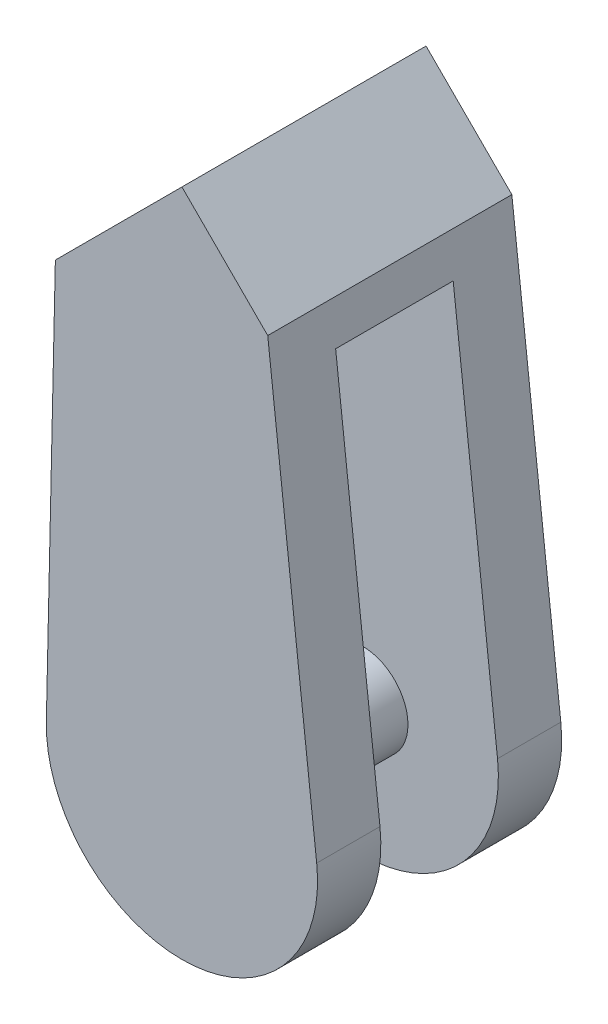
from build123d import *

# Parameters (mm, degrees)
BASE_EXTRUSION_DEPTH    = 1.35
ESQUISSE3_W             = 20
ESQUISSE3_H             = 20
ENL_V_MAT_EXTRU_1_DEPTH = 0.65
ESQUISSE4_R             = 0.5
BOSS_EXTRU_1_DEPTH      = 1.35


with BuildPart() as part:
    # Esquisse2 → Base-Extrusion (new, symmetric)
    with BuildSketch(Plane.XY):
        with BuildLine():
            Line((-1.4, 4.5), (-1.499627, 0.033449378))
            ThreePointArc((-1.499627, 0.033449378), (0.067821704, -1.498465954), (1.490473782, 0.168783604))
            Line((1.490473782, 0.168783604), (1, 4.5))
            Line((1, 4.5), (0.94891886, 4.95108114))
            Line((0.94891886, 4.95108114), (0, 5.9))
            Line((0, 5.9), (-1.4, 4.5))
        make_face()
    extrude(amount=BASE_EXTRUSION_DEPTH, both=True)

    # Esquisse3 → Enl_v. mat.-Extru.1 (cut, symmetric)
    with BuildSketch(Plane.XY):
        with Locations((0, -5.5)):
            Rectangle(ESQUISSE3_W, ESQUISSE3_H)
    extrude(amount=ENL_V_MAT_EXTRU_1_DEPTH, both=True, mode=Mode.SUBTRACT)

    # Esquisse4 → Boss.-Extru.1 (add, symmetric)
    with BuildSketch(Plane.XY):
        Circle(ESQUISSE4_R)
    extrude(amount=BOSS_EXTRU_1_DEPTH, both=True)


solid = part.part
